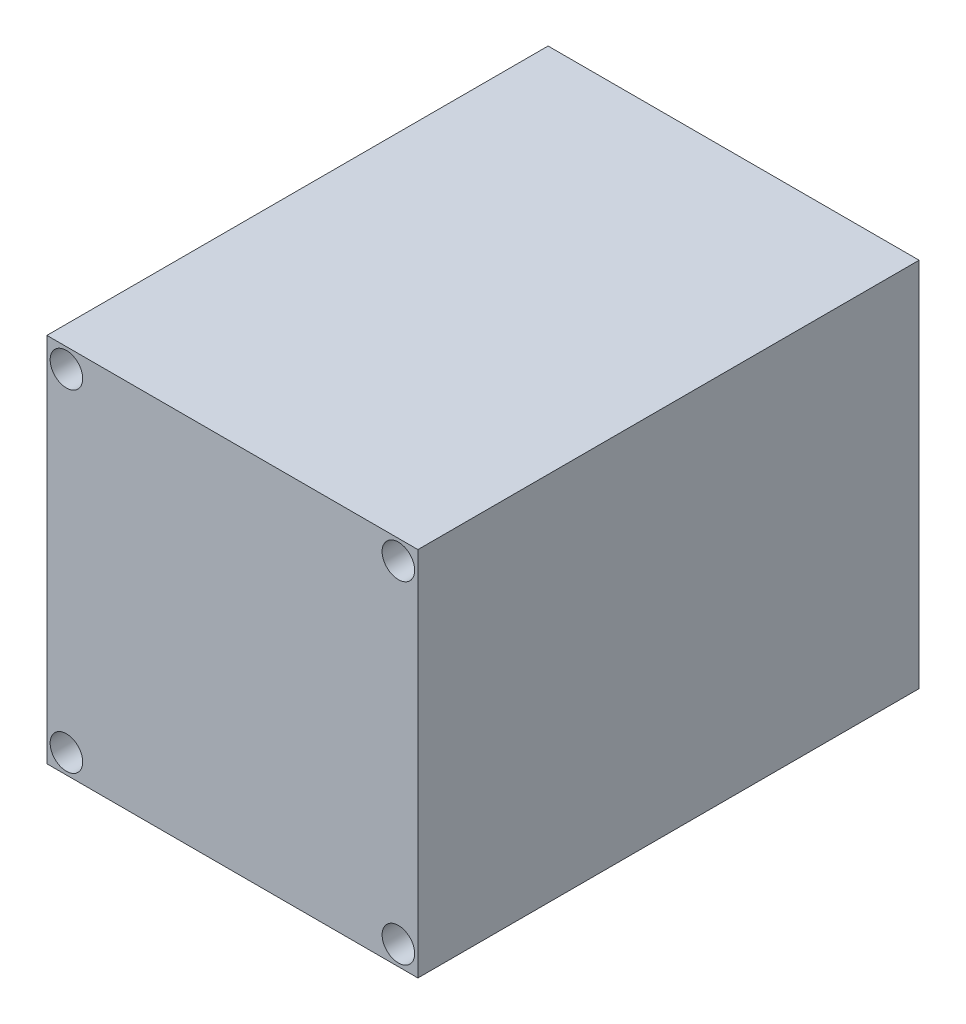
from build123d import *

# Parameters (mm, degrees)
SKETCH1_W           = 57
SKETCH1_H           = 57
SKETCH1_R           = 2.5
BOSS_EXTRUDE1_DEPTH = 77
SKETCH2_R           = 19
BOSS_EXTRUDE2_DEPTH = 2
SKETCH3_R           = 3.2
BOSS_EXTRUDE3_DEPTH = 21


with BuildPart() as part:
    # Sketch1 → Boss-Extrude1 (new body)
    with BuildSketch(Plane.XY):
        Rectangle(SKETCH1_W, SKETCH1_H)
        with Locations((-25.5, 25.5)):
            Circle(SKETCH1_R, mode=Mode.SUBTRACT)
        with Locations(Location((25.5, 25.5, 0), (0, 0, 180))):
            Circle(SKETCH1_R, mode=Mode.SUBTRACT)
        with Locations((25.5, -25.5)):
            Circle(SKETCH1_R, mode=Mode.SUBTRACT)
        with Locations(Location((-25.5, -25.5, 0), (0, 0, 180))):
            Circle(SKETCH1_R, mode=Mode.SUBTRACT)
    extrude(amount=BOSS_EXTRUDE1_DEPTH)

    # Sketch2 → Boss-Extrude2 (add)
    with BuildSketch(Plane(origin=(0, 0, 0), x_dir=(-1, 0, 0), z_dir=(0, 0, -1))):
        with Locations(Location((0, 0, 0), (0, 0, 180))):
            Circle(SKETCH2_R)
    extrude(amount=BOSS_EXTRUDE2_DEPTH)

    # Sketch3 → Boss-Extrude3 (add)
    with BuildSketch(Plane(origin=(0, 0, -2), x_dir=(-1, 0, 0), z_dir=(0, 0, -1))):
        with Locations(Location((0, 0, 0), (0, 0, 180))):
            Circle(SKETCH3_R)
    extrude(amount=BOSS_EXTRUDE3_DEPTH)


solid = part.part
